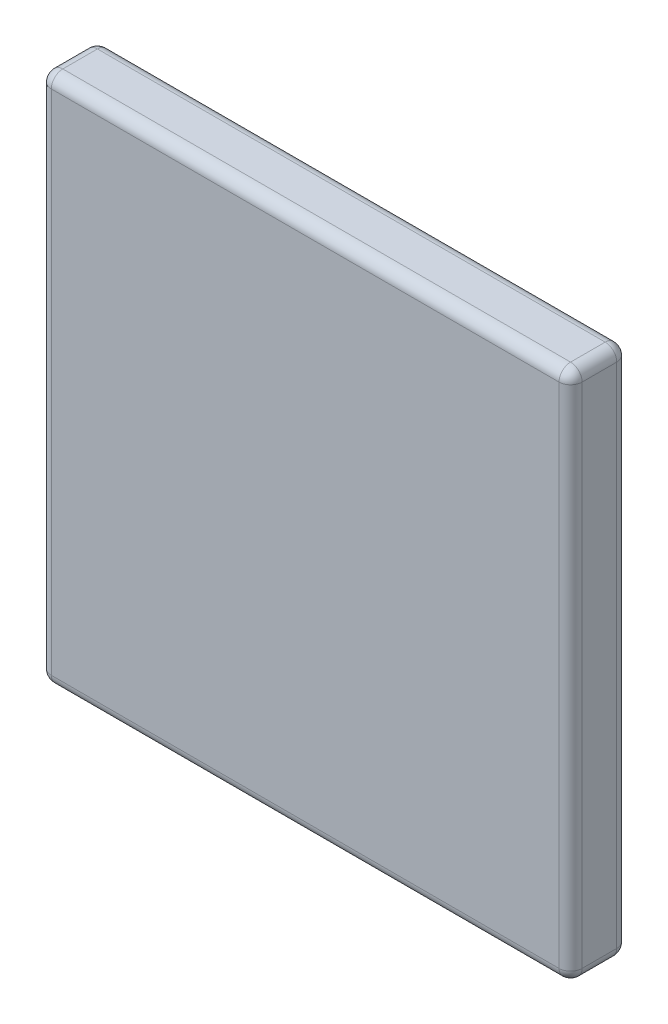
ISO-10303-21;
HEADER;
FILE_DESCRIPTION(('STEP AP214'),'2;1');
FILE_NAME('part.step','',(''),(''),'','','');
FILE_SCHEMA(('AUTOMOTIVE_DESIGN { 1 0 10303 214 1 1 1 1 }'));
ENDSEC;
DATA;
#1=APPLICATION_CONTEXT('core data for automotive mechanical design processes');
#2=APPLICATION_PROTOCOL_DEFINITION('international standard','automotive_design',2000,#1);
#3=PRODUCT_CONTEXT('',#1,'mechanical');
#4=PRODUCT('Part','Part','',(#3));
#5=PRODUCT_RELATED_PRODUCT_CATEGORY('part','',(#4));
#6=PRODUCT_DEFINITION_FORMATION('','',#4);
#7=PRODUCT_DEFINITION_CONTEXT('part definition',#1,'design');
#8=PRODUCT_DEFINITION('design','',#6,#7);
#9=PRODUCT_DEFINITION_SHAPE('','',#8);
#10=(LENGTH_UNIT() NAMED_UNIT(*) SI_UNIT(.MILLI.,.METRE.));
#11=(NAMED_UNIT(*) PLANE_ANGLE_UNIT() SI_UNIT($,.RADIAN.));
#12=(NAMED_UNIT(*) SI_UNIT($,.STERADIAN.) SOLID_ANGLE_UNIT());
#13=UNCERTAINTY_MEASURE_WITH_UNIT(LENGTH_MEASURE(1.E-05),#10,'distance_accuracy_value','');
#14=(GEOMETRIC_REPRESENTATION_CONTEXT(3) GLOBAL_UNCERTAINTY_ASSIGNED_CONTEXT((#13)) GLOBAL_UNIT_ASSIGNED_CONTEXT((#10,
#11,#12)) REPRESENTATION_CONTEXT('',''));
#15=CARTESIAN_POINT('',(0.,0.,0.));
#16=DIRECTION('',(0.,0.,1.));
#17=DIRECTION('',(1.,0.,0.));
#18=AXIS2_PLACEMENT_3D('',#15,#16,#17);
#19=CARTESIAN_POINT('',(5.58800000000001,-5.588,1.016));
#20=DIRECTION('',(1.,0.,0.));
#21=DIRECTION('',(0.,1.,0.));
#22=AXIS2_PLACEMENT_3D('',#19,#20,#21);
#23=SPHERICAL_SURFACE('',#22,0.254);
#24=CARTESIAN_POINT('',(5.58800000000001,-5.588,1.016));
#25=DIRECTION('',(0.,0.,1.));
#26=DIRECTION('',(1.,0.,0.));
#27=AXIS2_PLACEMENT_3D('',#24,#25,#26);
#28=CIRCLE('',#27,0.254);
#29=CARTESIAN_POINT('',(5.84200000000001,-5.588,1.016));
#30=VERTEX_POINT('',#29);
#31=CARTESIAN_POINT('',(5.58800000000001,-5.842,1.016));
#32=VERTEX_POINT('',#31);
#33=EDGE_CURVE('E292',#30,#32,#28,.F.);
#34=ORIENTED_EDGE('',*,*,#33,.F.);
#35=CARTESIAN_POINT('',(5.58800000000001,-5.588,1.016));
#36=DIRECTION('',(0.,-1.,0.));
#37=DIRECTION('',(0.,0.,-1.));
#38=AXIS2_PLACEMENT_3D('',#35,#36,#37);
#39=CIRCLE('',#38,0.254);
#40=CARTESIAN_POINT('',(5.58800000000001,-5.58799999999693,1.27));
#41=VERTEX_POINT('',#40);
#42=EDGE_CURVE('E115',#41,#30,#39,.F.);
#43=ORIENTED_EDGE('',*,*,#42,.F.);
#44=CARTESIAN_POINT('',(5.58800000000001,-5.588,1.016));
#45=DIRECTION('',(-1.,0.,0.));
#46=DIRECTION('',(0.,0.,1.));
#47=AXIS2_PLACEMENT_3D('',#44,#45,#46);
#48=CIRCLE('',#47,0.254);
#49=EDGE_CURVE('E104',#32,#41,#48,.T.);
#50=ORIENTED_EDGE('',*,*,#49,.F.);
#51=EDGE_LOOP('',(#34,#43,#50));
#52=FACE_BOUND('',#51,.T.);
#53=ADVANCED_FACE('F17',(#52),#23,.T.);
#54=CARTESIAN_POINT('',(5.58800000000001,5.588,1.016));
#55=DIRECTION('',(1.,0.,0.));
#56=DIRECTION('',(0.,1.,0.));
#57=AXIS2_PLACEMENT_3D('',#54,#55,#56);
#58=SPHERICAL_SURFACE('',#57,0.254);
#59=CARTESIAN_POINT('',(5.58800000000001,5.588,1.016));
#60=DIRECTION('',(0.,0.,1.));
#61=DIRECTION('',(1.,0.,0.));
#62=AXIS2_PLACEMENT_3D('',#59,#60,#61);
#63=CIRCLE('',#62,0.254);
#64=CARTESIAN_POINT('',(5.58800000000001,5.842,1.016));
#65=VERTEX_POINT('',#64);
#66=CARTESIAN_POINT('',(5.84200000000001,5.588,1.016));
#67=VERTEX_POINT('',#66);
#68=EDGE_CURVE('E288',#65,#67,#63,.F.);
#69=ORIENTED_EDGE('',*,*,#68,.F.);
#70=CARTESIAN_POINT('',(5.58800000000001,5.588,1.016));
#71=DIRECTION('',(1.,0.,0.));
#72=DIRECTION('',(0.,0.,-1.));
#73=AXIS2_PLACEMENT_3D('',#70,#71,#72);
#74=CIRCLE('',#73,0.254);
#75=CARTESIAN_POINT('',(5.58800000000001,5.588,1.27));
#76=VERTEX_POINT('',#75);
#77=EDGE_CURVE('E287',#76,#65,#74,.F.);
#78=ORIENTED_EDGE('',*,*,#77,.F.);
#79=CARTESIAN_POINT('',(5.58800000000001,5.588,1.016));
#80=DIRECTION('',(0.,-1.,0.));
#81=DIRECTION('',(0.,0.,-1.));
#82=AXIS2_PLACEMENT_3D('',#79,#80,#81);
#83=CIRCLE('',#82,0.254);
#84=EDGE_CURVE('E281',#67,#76,#83,.T.);
#85=ORIENTED_EDGE('',*,*,#84,.F.);
#86=EDGE_LOOP('',(#69,#78,#85));
#87=FACE_BOUND('',#86,.T.);
#88=ADVANCED_FACE('F156',(#87),#58,.T.);
#89=CARTESIAN_POINT('',(-5.58799999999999,-5.588,1.016));
#90=DIRECTION('',(1.,0.,0.));
#91=DIRECTION('',(0.,1.,0.));
#92=AXIS2_PLACEMENT_3D('',#89,#90,#91);
#93=SPHERICAL_SURFACE('',#92,0.254);
#94=CARTESIAN_POINT('',(-5.58799999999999,-5.588,1.016));
#95=DIRECTION('',(0.,0.,1.));
#96=DIRECTION('',(1.,0.,0.));
#97=AXIS2_PLACEMENT_3D('',#94,#95,#96);
#98=CIRCLE('',#97,0.254);
#99=CARTESIAN_POINT('',(-5.58799999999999,-5.842,1.016));
#100=VERTEX_POINT('',#99);
#101=CARTESIAN_POINT('',(-5.84199999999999,-5.588,1.016));
#102=VERTEX_POINT('',#101);
#103=EDGE_CURVE('E138',#100,#102,#98,.F.);
#104=ORIENTED_EDGE('',*,*,#103,.F.);
#105=CARTESIAN_POINT('',(-5.58799999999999,-5.588,1.016));
#106=DIRECTION('',(-1.,0.,0.));
#107=DIRECTION('',(0.,0.,1.));
#108=AXIS2_PLACEMENT_3D('',#105,#106,#107);
#109=CIRCLE('',#108,0.254);
#110=CARTESIAN_POINT('',(-5.58799999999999,-5.588,1.27));
#111=VERTEX_POINT('',#110);
#112=EDGE_CURVE('E111',#111,#100,#109,.F.);
#113=ORIENTED_EDGE('',*,*,#112,.F.);
#114=CARTESIAN_POINT('',(-5.58799999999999,-5.588,1.016));
#115=DIRECTION('',(0.,1.,0.));
#116=DIRECTION('',(-1.,0.,0.));
#117=AXIS2_PLACEMENT_3D('',#114,#115,#116);
#118=CIRCLE('',#117,0.254);
#119=EDGE_CURVE('E126',#102,#111,#118,.T.);
#120=ORIENTED_EDGE('',*,*,#119,.F.);
#121=EDGE_LOOP('',(#104,#113,#120));
#122=FACE_BOUND('',#121,.T.);
#123=ADVANCED_FACE('F137',(#122),#93,.T.);
#124=CARTESIAN_POINT('',(0.,0.,1.27));
#125=DIRECTION('',(0.,0.,1.));
#126=DIRECTION('',(1.,0.,0.));
#127=AXIS2_PLACEMENT_3D('',#124,#125,#126);
#128=PLANE('',#127);
#129=DIRECTION('',(0.,1.,0.));
#130=VECTOR('',#129,1.);
#131=CARTESIAN_POINT('',(-5.588,0.,1.27));
#132=LINE('',#131,#130);
#133=CARTESIAN_POINT('',(-5.58800000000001,5.58799999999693,1.27));
#134=VERTEX_POINT('',#133);
#135=EDGE_CURVE('E119',#111,#134,#132,.T.);
#136=ORIENTED_EDGE('',*,*,#135,.F.);
#137=DIRECTION('',(-1.,0.,0.));
#138=VECTOR('',#137,1.);
#139=CARTESIAN_POINT('',(0.,-5.588,1.27));
#140=LINE('',#139,#138);
#141=EDGE_CURVE('E107',#41,#111,#140,.T.);
#142=ORIENTED_EDGE('',*,*,#141,.F.);
#143=DIRECTION('',(0.,-1.,0.));
#144=VECTOR('',#143,1.);
#145=CARTESIAN_POINT('',(5.58800000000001,0.,1.27));
#146=LINE('',#145,#144);
#147=EDGE_CURVE('E283',#76,#41,#146,.T.);
#148=ORIENTED_EDGE('',*,*,#147,.F.);
#149=DIRECTION('',(1.,0.,0.));
#150=VECTOR('',#149,1.);
#151=CARTESIAN_POINT('',(0.,5.588,1.27));
#152=LINE('',#151,#150);
#153=EDGE_CURVE('E123',#134,#76,#152,.T.);
#154=ORIENTED_EDGE('',*,*,#153,.F.);
#155=EDGE_LOOP('',(#136,#142,#148,#154));
#156=FACE_BOUND('',#155,.T.);
#157=ADVANCED_FACE('F121',(#156),#128,.T.);
#158=CARTESIAN_POINT('',(-5.58800000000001,5.588,1.016));
#159=DIRECTION('',(1.,0.,0.));
#160=DIRECTION('',(0.,1.,0.));
#161=AXIS2_PLACEMENT_3D('',#158,#159,#160);
#162=SPHERICAL_SURFACE('',#161,0.254);
#163=CARTESIAN_POINT('',(-5.58800000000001,5.588,1.016));
#164=DIRECTION('',(0.,0.,1.));
#165=DIRECTION('',(1.,0.,0.));
#166=AXIS2_PLACEMENT_3D('',#163,#164,#165);
#167=CIRCLE('',#166,0.254);
#168=CARTESIAN_POINT('',(-5.84200000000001,5.588,1.016));
#169=VERTEX_POINT('',#168);
#170=CARTESIAN_POINT('',(-5.58800000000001,5.842,1.016));
#171=VERTEX_POINT('',#170);
#172=EDGE_CURVE('E125',#169,#171,#167,.F.);
#173=ORIENTED_EDGE('',*,*,#172,.F.);
#174=CARTESIAN_POINT('',(-5.58800000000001,5.588,1.016));
#175=DIRECTION('',(0.,1.,0.));
#176=DIRECTION('',(-1.,0.,0.));
#177=AXIS2_PLACEMENT_3D('',#174,#175,#176);
#178=CIRCLE('',#177,0.254);
#179=EDGE_CURVE('E135',#134,#169,#178,.F.);
#180=ORIENTED_EDGE('',*,*,#179,.F.);
#181=CARTESIAN_POINT('',(-5.58800000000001,5.588,1.016));
#182=DIRECTION('',(1.,0.,0.));
#183=DIRECTION('',(0.,0.,-1.));
#184=AXIS2_PLACEMENT_3D('',#181,#182,#183);
#185=CIRCLE('',#184,0.254);
#186=EDGE_CURVE('E291',#171,#134,#185,.T.);
#187=ORIENTED_EDGE('',*,*,#186,.F.);
#188=EDGE_LOOP('',(#173,#180,#187));
#189=FACE_BOUND('',#188,.T.);
#190=ADVANCED_FACE('F147',(#189),#162,.T.);
#191=CARTESIAN_POINT('',(0.,-5.588,1.016));
#192=DIRECTION('',(-1.,0.,0.));
#193=DIRECTION('',(0.,0.,1.));
#194=AXIS2_PLACEMENT_3D('',#191,#192,#193);
#195=CYLINDRICAL_SURFACE('',#194,0.254);
#196=ORIENTED_EDGE('',*,*,#49,.T.);
#197=ORIENTED_EDGE('',*,*,#141,.T.);
#198=ORIENTED_EDGE('',*,*,#112,.T.);
#199=DIRECTION('',(1.,0.,0.));
#200=VECTOR('',#199,1.);
#201=CARTESIAN_POINT('',(0.,-5.842,1.016));
#202=LINE('',#201,#200);
#203=EDGE_CURVE('E317',#32,#100,#202,.F.);
#204=ORIENTED_EDGE('',*,*,#203,.F.);
#205=EDGE_LOOP('',(#196,#197,#198,#204));
#206=FACE_BOUND('',#205,.T.);
#207=ADVANCED_FACE('F109',(#206),#195,.T.);
#208=CARTESIAN_POINT('',(5.58800000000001,0.,1.016));
#209=DIRECTION('',(0.,-1.,0.));
#210=DIRECTION('',(0.,0.,-1.));
#211=AXIS2_PLACEMENT_3D('',#208,#209,#210);
#212=CYLINDRICAL_SURFACE('',#211,0.254);
#213=ORIENTED_EDGE('',*,*,#84,.T.);
#214=ORIENTED_EDGE('',*,*,#147,.T.);
#215=ORIENTED_EDGE('',*,*,#42,.T.);
#216=DIRECTION('',(0.,1.,0.));
#217=VECTOR('',#216,1.);
#218=CARTESIAN_POINT('',(5.84200000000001,0.,1.016));
#219=LINE('',#218,#217);
#220=EDGE_CURVE('E285',#67,#30,#219,.F.);
#221=ORIENTED_EDGE('',*,*,#220,.F.);
#222=EDGE_LOOP('',(#213,#214,#215,#221));
#223=FACE_BOUND('',#222,.T.);
#224=ADVANCED_FACE('F271',(#223),#212,.T.);
#225=CARTESIAN_POINT('',(5.58800000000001,-5.588,0.));
#226=DIRECTION('',(0.,0.,1.));
#227=DIRECTION('',(1.,0.,0.));
#228=AXIS2_PLACEMENT_3D('',#225,#226,#227);
#229=CYLINDRICAL_SURFACE('',#228,0.254);
#230=CARTESIAN_POINT('',(5.58800000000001,-5.588,0.254));
#231=DIRECTION('',(0.,0.,-1.));
#232=DIRECTION('',(1.,0.,0.));
#233=AXIS2_PLACEMENT_3D('',#230,#231,#232);
#234=CIRCLE('',#233,0.254);
#235=CARTESIAN_POINT('',(5.84200000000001,-5.588,0.254));
#236=VERTEX_POINT('',#235);
#237=CARTESIAN_POINT('',(5.58800000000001,-5.842,0.254));
#238=VERTEX_POINT('',#237);
#239=EDGE_CURVE('E235',#236,#238,#234,.T.);
#240=ORIENTED_EDGE('',*,*,#239,.F.);
#241=DIRECTION('',(0.,0.,-1.));
#242=VECTOR('',#241,1.);
#243=CARTESIAN_POINT('',(5.84200000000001,-5.588,0.));
#244=LINE('',#243,#242);
#245=EDGE_CURVE('E304',#30,#236,#244,.T.);
#246=ORIENTED_EDGE('',*,*,#245,.F.);
#247=ORIENTED_EDGE('',*,*,#33,.T.);
#248=DIRECTION('',(0.,0.,-1.));
#249=VECTOR('',#248,1.);
#250=CARTESIAN_POINT('',(5.58800000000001,-5.842,0.));
#251=LINE('',#250,#249);
#252=EDGE_CURVE('E319',#238,#32,#251,.F.);
#253=ORIENTED_EDGE('',*,*,#252,.F.);
#254=EDGE_LOOP('',(#240,#246,#247,#253));
#255=FACE_BOUND('',#254,.T.);
#256=ADVANCED_FACE('F268',(#255),#229,.T.);
#257=CARTESIAN_POINT('',(0.,5.588,1.016));
#258=DIRECTION('',(1.,0.,0.));
#259=DIRECTION('',(0.,0.,-1.));
#260=AXIS2_PLACEMENT_3D('',#257,#258,#259);
#261=CYLINDRICAL_SURFACE('',#260,0.254);
#262=ORIENTED_EDGE('',*,*,#186,.T.);
#263=ORIENTED_EDGE('',*,*,#153,.T.);
#264=ORIENTED_EDGE('',*,*,#77,.T.);
#265=DIRECTION('',(1.,0.,0.));
#266=VECTOR('',#265,1.);
#267=CARTESIAN_POINT('',(0.,5.842,1.016));
#268=LINE('',#267,#266);
#269=EDGE_CURVE('E229',#171,#65,#268,.T.);
#270=ORIENTED_EDGE('',*,*,#269,.F.);
#271=EDGE_LOOP('',(#262,#263,#264,#270));
#272=FACE_BOUND('',#271,.T.);
#273=ADVANCED_FACE('F264',(#272),#261,.T.);
#274=CARTESIAN_POINT('',(5.58800000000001,5.588,0.));
#275=DIRECTION('',(0.,0.,1.));
#276=DIRECTION('',(1.,0.,0.));
#277=AXIS2_PLACEMENT_3D('',#274,#275,#276);
#278=CYLINDRICAL_SURFACE('',#277,0.254);
#279=CARTESIAN_POINT('',(5.58800000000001,5.588,0.254));
#280=DIRECTION('',(0.,0.,1.));
#281=DIRECTION('',(1.,0.,0.));
#282=AXIS2_PLACEMENT_3D('',#279,#280,#281);
#283=CIRCLE('',#282,0.254);
#284=CARTESIAN_POINT('',(5.58800000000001,5.842,0.254));
#285=VERTEX_POINT('',#284);
#286=CARTESIAN_POINT('',(5.84200000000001,5.588,0.254));
#287=VERTEX_POINT('',#286);
#288=EDGE_CURVE('E225',#285,#287,#283,.F.);
#289=ORIENTED_EDGE('',*,*,#288,.F.);
#290=DIRECTION('',(0.,0.,1.));
#291=VECTOR('',#290,1.);
#292=CARTESIAN_POINT('',(5.58800000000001,5.842,0.));
#293=LINE('',#292,#291);
#294=EDGE_CURVE('E227',#65,#285,#293,.F.);
#295=ORIENTED_EDGE('',*,*,#294,.F.);
#296=ORIENTED_EDGE('',*,*,#68,.T.);
#297=DIRECTION('',(0.,0.,-1.));
#298=VECTOR('',#297,1.);
#299=CARTESIAN_POINT('',(5.84200000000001,5.588,0.));
#300=LINE('',#299,#298);
#301=EDGE_CURVE('E307',#287,#67,#300,.F.);
#302=ORIENTED_EDGE('',*,*,#301,.F.);
#303=EDGE_LOOP('',(#289,#295,#296,#302));
#304=FACE_BOUND('',#303,.T.);
#305=ADVANCED_FACE('F260',(#304),#278,.T.);
#306=CARTESIAN_POINT('',(-5.58799999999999,-5.588,0.));
#307=DIRECTION('',(0.,0.,1.));
#308=DIRECTION('',(1.,0.,0.));
#309=AXIS2_PLACEMENT_3D('',#306,#307,#308);
#310=CYLINDRICAL_SURFACE('',#309,0.254);
#311=CARTESIAN_POINT('',(-5.58799999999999,-5.588,0.254));
#312=DIRECTION('',(0.,0.,-1.));
#313=DIRECTION('',(1.,0.,0.));
#314=AXIS2_PLACEMENT_3D('',#311,#312,#313);
#315=CIRCLE('',#314,0.254);
#316=CARTESIAN_POINT('',(-5.58799999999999,-5.842,0.254));
#317=VERTEX_POINT('',#316);
#318=CARTESIAN_POINT('',(-5.84199999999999,-5.588,0.254));
#319=VERTEX_POINT('',#318);
#320=EDGE_CURVE('E209',#317,#319,#315,.T.);
#321=ORIENTED_EDGE('',*,*,#320,.F.);
#322=DIRECTION('',(0.,0.,-1.));
#323=VECTOR('',#322,1.);
#324=CARTESIAN_POINT('',(-5.58799999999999,-5.842,0.));
#325=LINE('',#324,#323);
#326=EDGE_CURVE('E315',#100,#317,#325,.T.);
#327=ORIENTED_EDGE('',*,*,#326,.F.);
#328=ORIENTED_EDGE('',*,*,#103,.T.);
#329=DIRECTION('',(0.,0.,1.));
#330=VECTOR('',#329,1.);
#331=CARTESIAN_POINT('',(-5.84199999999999,-5.588,0.));
#332=LINE('',#331,#330);
#333=EDGE_CURVE('E206',#319,#102,#332,.T.);
#334=ORIENTED_EDGE('',*,*,#333,.F.);
#335=EDGE_LOOP('',(#321,#327,#328,#334));
#336=FACE_BOUND('',#335,.T.);
#337=ADVANCED_FACE('F257',(#336),#310,.T.);
#338=CARTESIAN_POINT('',(-5.588,0.,1.016));
#339=DIRECTION('',(0.,1.,0.));
#340=DIRECTION('',(-1.,0.,0.));
#341=AXIS2_PLACEMENT_3D('',#338,#339,#340);
#342=CYLINDRICAL_SURFACE('',#341,0.254);
#343=ORIENTED_EDGE('',*,*,#119,.T.);
#344=ORIENTED_EDGE('',*,*,#135,.T.);
#345=ORIENTED_EDGE('',*,*,#179,.T.);
#346=DIRECTION('',(0.,-1.,0.));
#347=VECTOR('',#346,1.);
#348=CARTESIAN_POINT('',(-5.842,0.,1.016));
#349=LINE('',#348,#347);
#350=EDGE_CURVE('E132',#102,#169,#349,.F.);
#351=ORIENTED_EDGE('',*,*,#350,.F.);
#352=EDGE_LOOP('',(#343,#344,#345,#351));
#353=FACE_BOUND('',#352,.T.);
#354=ADVANCED_FACE('F130',(#353),#342,.T.);
#355=CARTESIAN_POINT('',(-5.58800000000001,5.588,0.));
#356=DIRECTION('',(0.,0.,1.));
#357=DIRECTION('',(1.,0.,0.));
#358=AXIS2_PLACEMENT_3D('',#355,#356,#357);
#359=CYLINDRICAL_SURFACE('',#358,0.254);
#360=CARTESIAN_POINT('',(-5.58800000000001,5.588,0.254));
#361=DIRECTION('',(0.,0.,1.));
#362=DIRECTION('',(1.,0.,0.));
#363=AXIS2_PLACEMENT_3D('',#360,#361,#362);
#364=CIRCLE('',#363,0.254);
#365=CARTESIAN_POINT('',(-5.84200000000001,5.588,0.254));
#366=VERTEX_POINT('',#365);
#367=CARTESIAN_POINT('',(-5.58800000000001,5.842,0.254));
#368=VERTEX_POINT('',#367);
#369=EDGE_CURVE('E201',#366,#368,#364,.F.);
#370=ORIENTED_EDGE('',*,*,#369,.F.);
#371=DIRECTION('',(0.,0.,1.));
#372=VECTOR('',#371,1.);
#373=CARTESIAN_POINT('',(-5.84200000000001,5.588,0.));
#374=LINE('',#373,#372);
#375=EDGE_CURVE('E203',#169,#366,#374,.F.);
#376=ORIENTED_EDGE('',*,*,#375,.F.);
#377=ORIENTED_EDGE('',*,*,#172,.T.);
#378=DIRECTION('',(0.,0.,1.));
#379=VECTOR('',#378,1.);
#380=CARTESIAN_POINT('',(-5.58800000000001,5.842,0.));
#381=LINE('',#380,#379);
#382=EDGE_CURVE('E232',#368,#171,#381,.T.);
#383=ORIENTED_EDGE('',*,*,#382,.F.);
#384=EDGE_LOOP('',(#370,#376,#377,#383));
#385=FACE_BOUND('',#384,.T.);
#386=ADVANCED_FACE('F250',(#385),#359,.T.);
#387=CARTESIAN_POINT('',(0.,-5.842,0.));
#388=DIRECTION('',(0.,-1.,0.));
#389=DIRECTION('',(0.,0.,-1.));
#390=AXIS2_PLACEMENT_3D('',#387,#388,#389);
#391=PLANE('',#390);
#392=ORIENTED_EDGE('',*,*,#203,.T.);
#393=ORIENTED_EDGE('',*,*,#326,.T.);
#394=DIRECTION('',(1.,0.,0.));
#395=VECTOR('',#394,1.);
#396=CARTESIAN_POINT('',(0.,-5.842,0.254));
#397=LINE('',#396,#395);
#398=EDGE_CURVE('E351',#238,#317,#397,.F.);
#399=ORIENTED_EDGE('',*,*,#398,.F.);
#400=ORIENTED_EDGE('',*,*,#252,.T.);
#401=EDGE_LOOP('',(#392,#393,#399,#400));
#402=FACE_BOUND('',#401,.T.);
#403=ADVANCED_FACE('F246',(#402),#391,.T.);
#404=CARTESIAN_POINT('',(5.84200000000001,0.,0.));
#405=DIRECTION('',(1.,0.,0.));
#406=DIRECTION('',(0.,0.,-1.));
#407=AXIS2_PLACEMENT_3D('',#404,#405,#406);
#408=PLANE('',#407);
#409=ORIENTED_EDGE('',*,*,#220,.T.);
#410=ORIENTED_EDGE('',*,*,#245,.T.);
#411=DIRECTION('',(0.,1.,0.));
#412=VECTOR('',#411,1.);
#413=CARTESIAN_POINT('',(5.84200000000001,0.,0.254));
#414=LINE('',#413,#412);
#415=EDGE_CURVE('E345',#287,#236,#414,.F.);
#416=ORIENTED_EDGE('',*,*,#415,.F.);
#417=ORIENTED_EDGE('',*,*,#301,.T.);
#418=EDGE_LOOP('',(#409,#410,#416,#417));
#419=FACE_BOUND('',#418,.T.);
#420=ADVANCED_FACE('F242',(#419),#408,.T.);
#421=CARTESIAN_POINT('',(5.58800000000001,-5.588,0.254));
#422=DIRECTION('',(1.,0.,0.));
#423=DIRECTION('',(0.,1.,0.));
#424=AXIS2_PLACEMENT_3D('',#421,#422,#423);
#425=SPHERICAL_SURFACE('',#424,0.254);
#426=CARTESIAN_POINT('',(5.58800000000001,-5.588,0.254));
#427=DIRECTION('',(1.,0.,0.));
#428=DIRECTION('',(0.,0.,-1.));
#429=AXIS2_PLACEMENT_3D('',#426,#427,#428);
#430=CIRCLE('',#429,0.254);
#431=CARTESIAN_POINT('',(5.58800000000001,-5.588,0.));
#432=VERTEX_POINT('',#431);
#433=EDGE_CURVE('E199',#432,#238,#430,.F.);
#434=ORIENTED_EDGE('',*,*,#433,.F.);
#435=CARTESIAN_POINT('',(5.58800000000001,-5.588,0.254));
#436=DIRECTION('',(0.,1.,0.));
#437=DIRECTION('',(0.,0.,1.));
#438=AXIS2_PLACEMENT_3D('',#435,#436,#437);
#439=CIRCLE('',#438,0.254);
#440=EDGE_CURVE('E340',#236,#432,#439,.T.);
#441=ORIENTED_EDGE('',*,*,#440,.F.);
#442=ORIENTED_EDGE('',*,*,#239,.T.);
#443=EDGE_LOOP('',(#434,#441,#442));
#444=FACE_BOUND('',#443,.T.);
#445=ADVANCED_FACE('F239',(#444),#425,.T.);
#446=CARTESIAN_POINT('',(0.,5.842,0.));
#447=DIRECTION('',(0.,1.,0.));
#448=DIRECTION('',(0.,0.,1.));
#449=AXIS2_PLACEMENT_3D('',#446,#447,#448);
#450=PLANE('',#449);
#451=ORIENTED_EDGE('',*,*,#269,.T.);
#452=ORIENTED_EDGE('',*,*,#294,.T.);
#453=DIRECTION('',(-1.,0.,0.));
#454=VECTOR('',#453,1.);
#455=CARTESIAN_POINT('',(0.,5.842,0.254));
#456=LINE('',#455,#454);
#457=EDGE_CURVE('E330',#368,#285,#456,.F.);
#458=ORIENTED_EDGE('',*,*,#457,.F.);
#459=ORIENTED_EDGE('',*,*,#382,.T.);
#460=EDGE_LOOP('',(#451,#452,#458,#459));
#461=FACE_BOUND('',#460,.T.);
#462=ADVANCED_FACE('F220',(#461),#450,.T.);
#463=CARTESIAN_POINT('',(5.58800000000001,5.588,0.254));
#464=DIRECTION('',(1.,0.,0.));
#465=DIRECTION('',(0.,1.,0.));
#466=AXIS2_PLACEMENT_3D('',#463,#464,#465);
#467=SPHERICAL_SURFACE('',#466,0.254);
#468=CARTESIAN_POINT('',(5.58800000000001,5.588,0.254));
#469=DIRECTION('',(0.,1.,0.));
#470=DIRECTION('',(0.,0.,1.));
#471=AXIS2_PLACEMENT_3D('',#468,#469,#470);
#472=CIRCLE('',#471,0.254);
#473=CARTESIAN_POINT('',(5.58800000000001,5.58799999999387,0.));
#474=VERTEX_POINT('',#473);
#475=EDGE_CURVE('E347',#474,#287,#472,.F.);
#476=ORIENTED_EDGE('',*,*,#475,.F.);
#477=CARTESIAN_POINT('',(5.58800000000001,5.588,0.254));
#478=DIRECTION('',(-1.,0.,0.));
#479=DIRECTION('',(0.,0.,1.));
#480=AXIS2_PLACEMENT_3D('',#477,#478,#479);
#481=CIRCLE('',#480,0.254);
#482=EDGE_CURVE('E333',#285,#474,#481,.T.);
#483=ORIENTED_EDGE('',*,*,#482,.F.);
#484=ORIENTED_EDGE('',*,*,#288,.T.);
#485=EDGE_LOOP('',(#476,#483,#484));
#486=FACE_BOUND('',#485,.T.);
#487=ADVANCED_FACE('F216',(#486),#467,.T.);
#488=CARTESIAN_POINT('',(-5.58799999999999,-5.588,0.254));
#489=DIRECTION('',(1.,0.,0.));
#490=DIRECTION('',(0.,1.,0.));
#491=AXIS2_PLACEMENT_3D('',#488,#489,#490);
#492=SPHERICAL_SURFACE('',#491,0.254);
#493=CARTESIAN_POINT('',(-5.58799999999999,-5.588,0.254));
#494=DIRECTION('',(0.,-1.,0.));
#495=DIRECTION('',(1.,0.,0.));
#496=AXIS2_PLACEMENT_3D('',#493,#494,#495);
#497=CIRCLE('',#496,0.254);
#498=CARTESIAN_POINT('',(-5.58799999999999,-5.58799999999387,0.));
#499=VERTEX_POINT('',#498);
#500=EDGE_CURVE('E338',#499,#319,#497,.F.);
#501=ORIENTED_EDGE('',*,*,#500,.F.);
#502=CARTESIAN_POINT('',(-5.58799999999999,-5.588,0.254));
#503=DIRECTION('',(1.,0.,0.));
#504=DIRECTION('',(0.,0.,-1.));
#505=AXIS2_PLACEMENT_3D('',#502,#503,#504);
#506=CIRCLE('',#505,0.254);
#507=EDGE_CURVE('E350',#317,#499,#506,.T.);
#508=ORIENTED_EDGE('',*,*,#507,.F.);
#509=ORIENTED_EDGE('',*,*,#320,.T.);
#510=EDGE_LOOP('',(#501,#508,#509));
#511=FACE_BOUND('',#510,.T.);
#512=ADVANCED_FACE('F213',(#511),#492,.T.);
#513=CARTESIAN_POINT('',(-5.842,0.,0.));
#514=DIRECTION('',(-1.,0.,0.));
#515=DIRECTION('',(0.,-1.,0.));
#516=AXIS2_PLACEMENT_3D('',#513,#514,#515);
#517=PLANE('',#516);
#518=ORIENTED_EDGE('',*,*,#350,.T.);
#519=ORIENTED_EDGE('',*,*,#375,.T.);
#520=DIRECTION('',(0.,-1.,0.));
#521=VECTOR('',#520,1.);
#522=CARTESIAN_POINT('',(-5.842,0.,0.254));
#523=LINE('',#522,#521);
#524=EDGE_CURVE('E371',#319,#366,#523,.F.);
#525=ORIENTED_EDGE('',*,*,#524,.F.);
#526=ORIENTED_EDGE('',*,*,#333,.T.);
#527=EDGE_LOOP('',(#518,#519,#525,#526));
#528=FACE_BOUND('',#527,.T.);
#529=ADVANCED_FACE('F193',(#528),#517,.T.);
#530=CARTESIAN_POINT('',(-5.58800000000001,5.588,0.254));
#531=DIRECTION('',(1.,0.,0.));
#532=DIRECTION('',(0.,1.,0.));
#533=AXIS2_PLACEMENT_3D('',#530,#531,#532);
#534=SPHERICAL_SURFACE('',#533,0.254);
#535=CARTESIAN_POINT('',(-5.58800000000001,5.588,0.254));
#536=DIRECTION('',(0.,-1.,0.));
#537=DIRECTION('',(1.,0.,0.));
#538=AXIS2_PLACEMENT_3D('',#535,#536,#537);
#539=CIRCLE('',#538,0.254);
#540=CARTESIAN_POINT('',(-5.58800000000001,5.588,0.));
#541=VERTEX_POINT('',#540);
#542=EDGE_CURVE('E34',#366,#541,#539,.T.);
#543=ORIENTED_EDGE('',*,*,#542,.F.);
#544=ORIENTED_EDGE('',*,*,#369,.T.);
#545=CARTESIAN_POINT('',(-5.58800000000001,5.588,0.254));
#546=DIRECTION('',(-1.,0.,0.));
#547=DIRECTION('',(0.,0.,1.));
#548=AXIS2_PLACEMENT_3D('',#545,#546,#547);
#549=CIRCLE('',#548,0.254);
#550=EDGE_CURVE('E335',#541,#368,#549,.F.);
#551=ORIENTED_EDGE('',*,*,#550,.F.);
#552=EDGE_LOOP('',(#543,#544,#551));
#553=FACE_BOUND('',#552,.T.);
#554=ADVANCED_FACE('F188',(#553),#534,.T.);
#555=CARTESIAN_POINT('',(0.,-5.588,0.254));
#556=DIRECTION('',(1.,0.,0.));
#557=DIRECTION('',(0.,0.,-1.));
#558=AXIS2_PLACEMENT_3D('',#555,#556,#557);
#559=CYLINDRICAL_SURFACE('',#558,0.254);
#560=ORIENTED_EDGE('',*,*,#507,.T.);
#561=DIRECTION('',(1.,0.,0.));
#562=VECTOR('',#561,1.);
#563=CARTESIAN_POINT('',(0.,-5.588,0.));
#564=LINE('',#563,#562);
#565=EDGE_CURVE('E359',#499,#432,#564,.T.);
#566=ORIENTED_EDGE('',*,*,#565,.T.);
#567=ORIENTED_EDGE('',*,*,#433,.T.);
#568=ORIENTED_EDGE('',*,*,#398,.T.);
#569=EDGE_LOOP('',(#560,#566,#567,#568));
#570=FACE_BOUND('',#569,.T.);
#571=ADVANCED_FACE('F184',(#570),#559,.T.);
#572=CARTESIAN_POINT('',(5.58800000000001,0.,0.254));
#573=DIRECTION('',(0.,1.,0.));
#574=DIRECTION('',(0.,0.,1.));
#575=AXIS2_PLACEMENT_3D('',#572,#573,#574);
#576=CYLINDRICAL_SURFACE('',#575,0.254);
#577=ORIENTED_EDGE('',*,*,#440,.T.);
#578=DIRECTION('',(0.,1.,0.));
#579=VECTOR('',#578,1.);
#580=CARTESIAN_POINT('',(5.58800000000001,0.,0.));
#581=LINE('',#580,#579);
#582=EDGE_CURVE('E368',#432,#474,#581,.T.);
#583=ORIENTED_EDGE('',*,*,#582,.T.);
#584=ORIENTED_EDGE('',*,*,#475,.T.);
#585=ORIENTED_EDGE('',*,*,#415,.T.);
#586=EDGE_LOOP('',(#577,#583,#584,#585));
#587=FACE_BOUND('',#586,.T.);
#588=ADVANCED_FACE('F180',(#587),#576,.T.);
#589=CARTESIAN_POINT('',(0.,5.588,0.254));
#590=DIRECTION('',(-1.,0.,0.));
#591=DIRECTION('',(0.,0.,1.));
#592=AXIS2_PLACEMENT_3D('',#589,#590,#591);
#593=CYLINDRICAL_SURFACE('',#592,0.254);
#594=ORIENTED_EDGE('',*,*,#482,.T.);
#595=DIRECTION('',(1.,0.,0.));
#596=VECTOR('',#595,1.);
#597=CARTESIAN_POINT('',(0.,5.588,0.));
#598=LINE('',#597,#596);
#599=EDGE_CURVE('E26',#474,#541,#598,.F.);
#600=ORIENTED_EDGE('',*,*,#599,.T.);
#601=ORIENTED_EDGE('',*,*,#550,.T.);
#602=ORIENTED_EDGE('',*,*,#457,.T.);
#603=EDGE_LOOP('',(#594,#600,#601,#602));
#604=FACE_BOUND('',#603,.T.);
#605=ADVANCED_FACE('F174',(#604),#593,.T.);
#606=CARTESIAN_POINT('',(-5.588,0.,0.254));
#607=DIRECTION('',(0.,-1.,0.));
#608=DIRECTION('',(1.,0.,0.));
#609=AXIS2_PLACEMENT_3D('',#606,#607,#608);
#610=CYLINDRICAL_SURFACE('',#609,0.254);
#611=ORIENTED_EDGE('',*,*,#542,.T.);
#612=DIRECTION('',(0.,1.,0.));
#613=VECTOR('',#612,1.);
#614=CARTESIAN_POINT('',(-5.58800000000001,0.,0.));
#615=LINE('',#614,#613);
#616=EDGE_CURVE('E11',#541,#499,#615,.F.);
#617=ORIENTED_EDGE('',*,*,#616,.T.);
#618=ORIENTED_EDGE('',*,*,#500,.T.);
#619=ORIENTED_EDGE('',*,*,#524,.T.);
#620=EDGE_LOOP('',(#611,#617,#618,#619));
#621=FACE_BOUND('',#620,.T.);
#622=ADVANCED_FACE('F168',(#621),#610,.T.);
#623=CARTESIAN_POINT('',(0.,0.,0.));
#624=DIRECTION('',(0.,0.,1.));
#625=DIRECTION('',(1.,0.,0.));
#626=AXIS2_PLACEMENT_3D('',#623,#624,#625);
#627=PLANE('',#626);
#628=ORIENTED_EDGE('',*,*,#599,.F.);
#629=ORIENTED_EDGE('',*,*,#582,.F.);
#630=ORIENTED_EDGE('',*,*,#565,.F.);
#631=ORIENTED_EDGE('',*,*,#616,.F.);
#632=EDGE_LOOP('',(#628,#629,#630,#631));
#633=FACE_BOUND('',#632,.T.);
#634=ADVANCED_FACE('F166',(#633),#627,.F.);
#635=CLOSED_SHELL('',(#53,#88,#123,#157,#190,#207,#224,#256,#273,#305,#337,#354,#386,#403,#420,
#445,#462,#487,#512,#529,#554,#571,#588,#605,#622,#634));
#636=MANIFOLD_SOLID_BREP('B1',#635);
#637=ADVANCED_BREP_SHAPE_REPRESENTATION('',(#18,#636),#14);
#638=SHAPE_DEFINITION_REPRESENTATION(#9,#637);
ENDSEC;
END-ISO-10303-21;
